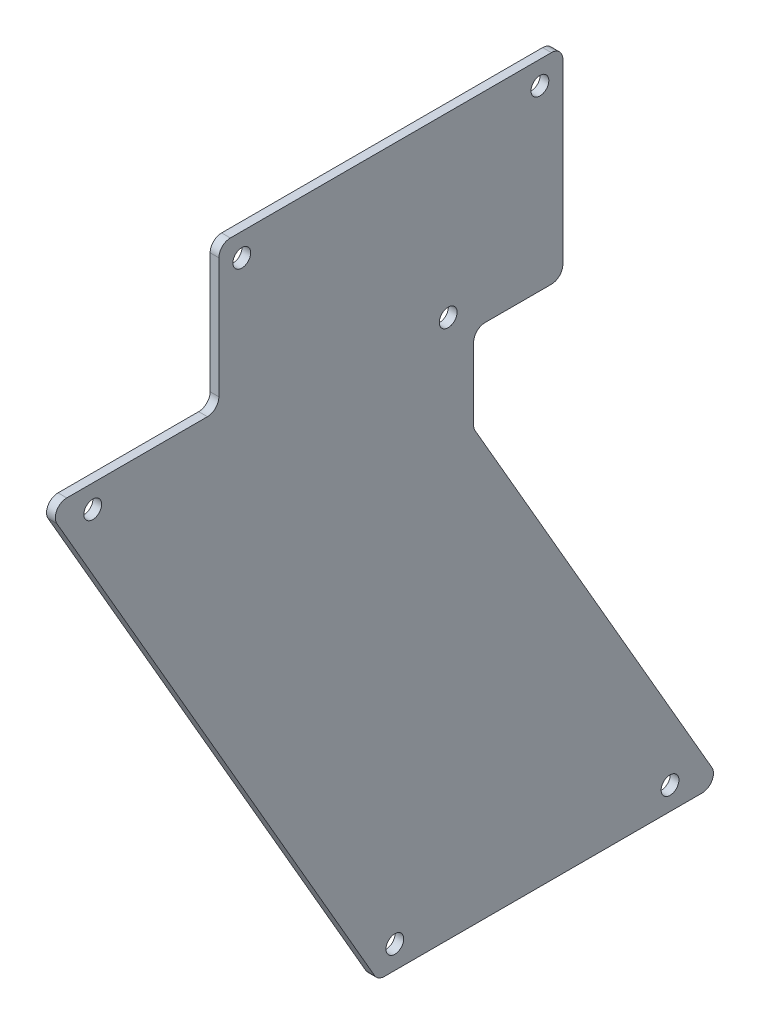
ISO-10303-21;
HEADER;
FILE_DESCRIPTION(('STEP AP214'),'2;1');
FILE_NAME('part.step','',(''),(''),'','','');
FILE_SCHEMA(('AUTOMOTIVE_DESIGN { 1 0 10303 214 1 1 1 1 }'));
ENDSEC;
DATA;
#1=APPLICATION_CONTEXT('core data for automotive mechanical design processes');
#2=APPLICATION_PROTOCOL_DEFINITION('international standard','automotive_design',2000,#1);
#3=PRODUCT_CONTEXT('',#1,'mechanical');
#4=PRODUCT('Part','Part','',(#3));
#5=PRODUCT_RELATED_PRODUCT_CATEGORY('part','',(#4));
#6=PRODUCT_DEFINITION_FORMATION('','',#4);
#7=PRODUCT_DEFINITION_CONTEXT('part definition',#1,'design');
#8=PRODUCT_DEFINITION('design','',#6,#7);
#9=PRODUCT_DEFINITION_SHAPE('','',#8);
#10=(LENGTH_UNIT() NAMED_UNIT(*) SI_UNIT(.MILLI.,.METRE.));
#11=(NAMED_UNIT(*) PLANE_ANGLE_UNIT() SI_UNIT($,.RADIAN.));
#12=(NAMED_UNIT(*) SI_UNIT($,.STERADIAN.) SOLID_ANGLE_UNIT());
#13=UNCERTAINTY_MEASURE_WITH_UNIT(LENGTH_MEASURE(1.E-05),#10,'distance_accuracy_value','');
#14=(GEOMETRIC_REPRESENTATION_CONTEXT(3) GLOBAL_UNCERTAINTY_ASSIGNED_CONTEXT((#13)) GLOBAL_UNIT_ASSIGNED_CONTEXT((#10,
#11,#12)) REPRESENTATION_CONTEXT('',''));
#15=CARTESIAN_POINT('',(0.,0.,0.));
#16=DIRECTION('',(0.,0.,1.));
#17=DIRECTION('',(1.,0.,0.));
#18=AXIS2_PLACEMENT_3D('',#15,#16,#17);
#19=CARTESIAN_POINT('',(1.524,0.,0.));
#20=DIRECTION('',(0.,1.,0.));
#21=DIRECTION('',(0.,0.,1.));
#22=AXIS2_PLACEMENT_3D('',#19,#20,#21);
#23=PLANE('',#22);
#24=DIRECTION('',(0.,0.,-1.));
#25=VECTOR('',#24,1.);
#26=CARTESIAN_POINT('',(0.,0.,0.));
#27=LINE('',#26,#25);
#28=CARTESIAN_POINT('',(0.,0.,18.8452994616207));
#29=VERTEX_POINT('',#28);
#30=CARTESIAN_POINT('',(0.,0.,-36.5358983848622));
#31=VERTEX_POINT('',#30);
#32=EDGE_CURVE('E186',#29,#31,#27,.T.);
#33=ORIENTED_EDGE('',*,*,#32,.T.);
#34=DIRECTION('',(-1.,0.,0.));
#35=VECTOR('',#34,1.);
#36=CARTESIAN_POINT('',(1.524,0.,-36.5358983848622));
#37=LINE('',#36,#35);
#38=CARTESIAN_POINT('',(1.524,0.,-36.5358983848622));
#39=VERTEX_POINT('',#38);
#40=EDGE_CURVE('E163',#31,#39,#37,.F.);
#41=ORIENTED_EDGE('',*,*,#40,.T.);
#42=DIRECTION('',(0.,0.,-1.));
#43=VECTOR('',#42,1.);
#44=CARTESIAN_POINT('',(1.524,0.,20.));
#45=LINE('',#44,#43);
#46=CARTESIAN_POINT('',(1.524,0.,18.8452994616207));
#47=VERTEX_POINT('',#46);
#48=EDGE_CURVE('E211',#47,#39,#45,.T.);
#49=ORIENTED_EDGE('',*,*,#48,.F.);
#50=DIRECTION('',(-1.,0.,0.));
#51=VECTOR('',#50,1.);
#52=CARTESIAN_POINT('',(1.524,0.,18.8452994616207));
#53=LINE('',#52,#51);
#54=EDGE_CURVE('E168',#47,#29,#53,.T.);
#55=ORIENTED_EDGE('',*,*,#54,.T.);
#56=EDGE_LOOP('',(#33,#41,#49,#55));
#57=FACE_BOUND('',#56,.T.);
#58=ADVANCED_FACE('F32',(#57),#23,.F.);
#59=CARTESIAN_POINT('',(1.524,0.,-40.));
#60=DIRECTION('',(0.,-0.500000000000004,0.866025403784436));
#61=DIRECTION('',(0.,-0.866025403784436,-0.500000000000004));
#62=AXIS2_PLACEMENT_3D('',#59,#60,#61);
#63=PLANE('',#62);
#64=DIRECTION('',(0.,0.866025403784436,0.500000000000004));
#65=VECTOR('',#64,1.);
#66=CARTESIAN_POINT('',(1.524,0.,-40.));
#67=LINE('',#66,#65);
#68=CARTESIAN_POINT('',(1.524,3.00000000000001,-38.2679491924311));
#69=VERTEX_POINT('',#68);
#70=CARTESIAN_POINT('',(1.524,74.5358983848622,3.03332099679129));
#71=VERTEX_POINT('',#70);
#72=EDGE_CURVE('E178',#69,#71,#67,.T.);
#73=ORIENTED_EDGE('',*,*,#72,.F.);
#74=DIRECTION('',(-1.,0.,0.));
#75=VECTOR('',#74,1.);
#76=CARTESIAN_POINT('',(1.524,3.00000000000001,-38.2679491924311));
#77=LINE('',#76,#75);
#78=CARTESIAN_POINT('',(0.,3.00000000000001,-38.2679491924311));
#79=VERTEX_POINT('',#78);
#80=EDGE_CURVE('E162',#69,#79,#77,.T.);
#81=ORIENTED_EDGE('',*,*,#80,.T.);
#82=DIRECTION('',(0.,0.866025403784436,0.500000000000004));
#83=VECTOR('',#82,1.);
#84=CARTESIAN_POINT('',(0.,0.,-40.));
#85=LINE('',#84,#83);
#86=CARTESIAN_POINT('',(0.,74.5358983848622,3.03332099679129));
#87=VERTEX_POINT('',#86);
#88=EDGE_CURVE('E175',#79,#87,#85,.T.);
#89=ORIENTED_EDGE('',*,*,#88,.T.);
#90=DIRECTION('',(-1.,0.,0.));
#91=VECTOR('',#90,1.);
#92=CARTESIAN_POINT('',(1.524,74.5358983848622,3.03332099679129));
#93=LINE('',#92,#91);
#94=EDGE_CURVE('E180',#87,#71,#93,.F.);
#95=ORIENTED_EDGE('',*,*,#94,.T.);
#96=EDGE_LOOP('',(#73,#81,#89,#95));
#97=FACE_BOUND('',#96,.T.);
#98=ADVANCED_FACE('F174',(#97),#63,.F.);
#99=CARTESIAN_POINT('',(1.524,75.,3.30127018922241));
#100=DIRECTION('',(0.,0.,1.));
#101=DIRECTION('',(0.,-1.,0.));
#102=AXIS2_PLACEMENT_3D('',#99,#100,#101);
#103=PLANE('',#102);
#104=DIRECTION('',(0.,1.,0.));
#105=VECTOR('',#104,1.);
#106=CARTESIAN_POINT('',(1.524,75.,3.30127018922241));
#107=LINE('',#106,#105);
#108=CARTESIAN_POINT('',(1.524,75.5358983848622,3.30127018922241));
#109=VERTEX_POINT('',#108);
#110=CARTESIAN_POINT('',(1.524,88.,3.30127018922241));
#111=VERTEX_POINT('',#110);
#112=EDGE_CURVE('E308',#109,#111,#107,.T.);
#113=ORIENTED_EDGE('',*,*,#112,.F.);
#114=DIRECTION('',(-1.,0.,0.));
#115=VECTOR('',#114,1.);
#116=CARTESIAN_POINT('',(0.,75.5358983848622,3.30127018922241));
#117=LINE('',#116,#115);
#118=CARTESIAN_POINT('',(0.,75.5358983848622,3.30127018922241));
#119=VERTEX_POINT('',#118);
#120=EDGE_CURVE('E242',#109,#119,#117,.T.);
#121=ORIENTED_EDGE('',*,*,#120,.T.);
#122=DIRECTION('',(0.,1.,0.));
#123=VECTOR('',#122,1.);
#124=CARTESIAN_POINT('',(0.,75.,3.30127018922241));
#125=LINE('',#124,#123);
#126=CARTESIAN_POINT('',(0.,88.,3.30127018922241));
#127=VERTEX_POINT('',#126);
#128=EDGE_CURVE('E185',#119,#127,#125,.T.);
#129=ORIENTED_EDGE('',*,*,#128,.T.);
#130=DIRECTION('',(-1.,0.,0.));
#131=VECTOR('',#130,1.);
#132=CARTESIAN_POINT('',(1.524,88.,3.30127018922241));
#133=LINE('',#132,#131);
#134=EDGE_CURVE('E240',#127,#111,#133,.F.);
#135=ORIENTED_EDGE('',*,*,#134,.T.);
#136=EDGE_LOOP('',(#113,#121,#129,#135));
#137=FACE_BOUND('',#136,.T.);
#138=ADVANCED_FACE('F386',(#137),#103,.F.);
#139=CARTESIAN_POINT('',(1.524,90.,3.30127018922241));
#140=DIRECTION('',(0.,1.,0.));
#141=DIRECTION('',(0.,0.,1.));
#142=AXIS2_PLACEMENT_3D('',#139,#140,#141);
#143=PLANE('',#142);
#144=DIRECTION('',(0.,0.,-1.));
#145=VECTOR('',#144,1.);
#146=CARTESIAN_POINT('',(1.524,90.,3.30127018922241));
#147=LINE('',#146,#145);
#148=CARTESIAN_POINT('',(1.524,90.,1.30127018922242));
#149=VERTEX_POINT('',#148);
#150=CARTESIAN_POINT('',(1.524,90.,-10.2649730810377));
#151=VERTEX_POINT('',#150);
#152=EDGE_CURVE('E305',#149,#151,#147,.T.);
#153=ORIENTED_EDGE('',*,*,#152,.F.);
#154=DIRECTION('',(-1.,0.,0.));
#155=VECTOR('',#154,1.);
#156=CARTESIAN_POINT('',(0.,90.,1.30127018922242));
#157=LINE('',#156,#155);
#158=CARTESIAN_POINT('',(0.,90.,1.30127018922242));
#159=VERTEX_POINT('',#158);
#160=EDGE_CURVE('E247',#149,#159,#157,.T.);
#161=ORIENTED_EDGE('',*,*,#160,.T.);
#162=DIRECTION('',(0.,0.,-1.));
#163=VECTOR('',#162,1.);
#164=CARTESIAN_POINT('',(0.,90.,3.30127018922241));
#165=LINE('',#164,#163);
#166=CARTESIAN_POINT('',(0.,90.,-10.2649730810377));
#167=VERTEX_POINT('',#166);
#168=EDGE_CURVE('E189',#159,#167,#165,.T.);
#169=ORIENTED_EDGE('',*,*,#168,.T.);
#170=DIRECTION('',(-1.,0.,0.));
#171=VECTOR('',#170,1.);
#172=CARTESIAN_POINT('',(1.524,90.,-10.2649730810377));
#173=LINE('',#172,#171);
#174=EDGE_CURVE('E245',#167,#151,#173,.F.);
#175=ORIENTED_EDGE('',*,*,#174,.T.);
#176=EDGE_LOOP('',(#153,#161,#169,#175));
#177=FACE_BOUND('',#176,.T.);
#178=ADVANCED_FACE('F437',(#177),#143,.F.);
#179=CARTESIAN_POINT('',(1.524,90.,-12.2649730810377));
#180=DIRECTION('',(0.,0.,1.));
#181=DIRECTION('',(1.,0.,0.));
#182=AXIS2_PLACEMENT_3D('',#179,#180,#181);
#183=PLANE('',#182);
#184=DIRECTION('',(0.,1.,0.));
#185=VECTOR('',#184,1.);
#186=CARTESIAN_POINT('',(1.524,90.,-12.2649730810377));
#187=LINE('',#186,#185);
#188=CARTESIAN_POINT('',(1.524,92.,-12.2649730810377));
#189=VERTEX_POINT('',#188);
#190=CARTESIAN_POINT('',(1.524,123.,-12.2649730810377));
#191=VERTEX_POINT('',#190);
#192=EDGE_CURVE('E302',#189,#191,#187,.T.);
#193=ORIENTED_EDGE('',*,*,#192,.F.);
#194=DIRECTION('',(-1.,0.,0.));
#195=VECTOR('',#194,1.);
#196=CARTESIAN_POINT('',(1.524,92.,-12.2649730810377));
#197=LINE('',#196,#195);
#198=CARTESIAN_POINT('',(0.,92.,-12.2649730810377));
#199=VERTEX_POINT('',#198);
#200=EDGE_CURVE('E252',#189,#199,#197,.T.);
#201=ORIENTED_EDGE('',*,*,#200,.T.);
#202=DIRECTION('',(0.,1.,0.));
#203=VECTOR('',#202,1.);
#204=CARTESIAN_POINT('',(0.,90.,-12.2649730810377));
#205=LINE('',#204,#203);
#206=CARTESIAN_POINT('',(0.,123.,-12.2649730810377));
#207=VERTEX_POINT('',#206);
#208=EDGE_CURVE('E197',#199,#207,#205,.T.);
#209=ORIENTED_EDGE('',*,*,#208,.T.);
#210=DIRECTION('',(-1.,0.,0.));
#211=VECTOR('',#210,1.);
#212=CARTESIAN_POINT('',(1.524,123.,-12.2649730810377));
#213=LINE('',#212,#211);
#214=EDGE_CURVE('E250',#207,#191,#213,.F.);
#215=ORIENTED_EDGE('',*,*,#214,.T.);
#216=EDGE_LOOP('',(#193,#201,#209,#215));
#217=FACE_BOUND('',#216,.T.);
#218=ADVANCED_FACE('F444',(#217),#183,.F.);
#219=CARTESIAN_POINT('',(1.524,125.,-12.2649730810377));
#220=DIRECTION('',(0.,-1.,0.));
#221=DIRECTION('',(0.,0.,-1.));
#222=AXIS2_PLACEMENT_3D('',#219,#220,#221);
#223=PLANE('',#222);
#224=DIRECTION('',(0.,0.,1.));
#225=VECTOR('',#224,1.);
#226=CARTESIAN_POINT('',(1.524,125.,-12.2649730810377));
#227=LINE('',#226,#225);
#228=CARTESIAN_POINT('',(1.524,125.,-10.2649730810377));
#229=VERTEX_POINT('',#228);
#230=CARTESIAN_POINT('',(1.524,125.,45.7350269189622));
#231=VERTEX_POINT('',#230);
#232=EDGE_CURVE('E297',#229,#231,#227,.T.);
#233=ORIENTED_EDGE('',*,*,#232,.F.);
#234=DIRECTION('',(-1.,0.,0.));
#235=VECTOR('',#234,1.);
#236=CARTESIAN_POINT('',(1.524,125.,-10.2649730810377));
#237=LINE('',#236,#235);
#238=CARTESIAN_POINT('',(0.,125.,-10.2649730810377));
#239=VERTEX_POINT('',#238);
#240=EDGE_CURVE('E257',#229,#239,#237,.T.);
#241=ORIENTED_EDGE('',*,*,#240,.T.);
#242=DIRECTION('',(0.,0.,1.));
#243=VECTOR('',#242,1.);
#244=CARTESIAN_POINT('',(0.,125.,-12.2649730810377));
#245=LINE('',#244,#243);
#246=CARTESIAN_POINT('',(0.,125.,45.7350269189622));
#247=VERTEX_POINT('',#246);
#248=EDGE_CURVE('E200',#239,#247,#245,.T.);
#249=ORIENTED_EDGE('',*,*,#248,.T.);
#250=DIRECTION('',(-1.,0.,0.));
#251=VECTOR('',#250,1.);
#252=CARTESIAN_POINT('',(1.524,125.,45.7350269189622));
#253=LINE('',#252,#251);
#254=EDGE_CURVE('E255',#247,#231,#253,.F.);
#255=ORIENTED_EDGE('',*,*,#254,.T.);
#256=EDGE_LOOP('',(#233,#241,#249,#255));
#257=FACE_BOUND('',#256,.T.);
#258=ADVANCED_FACE('F451',(#257),#223,.F.);
#259=CARTESIAN_POINT('',(1.524,125.,47.7350269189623));
#260=DIRECTION('',(0.,0.,-1.));
#261=DIRECTION('',(-1.,0.,0.));
#262=AXIS2_PLACEMENT_3D('',#259,#260,#261);
#263=PLANE('',#262);
#264=DIRECTION('',(0.,-1.,0.));
#265=VECTOR('',#264,1.);
#266=CARTESIAN_POINT('',(1.524,125.,47.7350269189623));
#267=LINE('',#266,#265);
#268=CARTESIAN_POINT('',(1.524,123.,47.7350269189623));
#269=VERTEX_POINT('',#268);
#270=CARTESIAN_POINT('',(1.524,102.,47.7350269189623));
#271=VERTEX_POINT('',#270);
#272=EDGE_CURVE('E292',#269,#271,#267,.T.);
#273=ORIENTED_EDGE('',*,*,#272,.F.);
#274=DIRECTION('',(-1.,0.,0.));
#275=VECTOR('',#274,1.);
#276=CARTESIAN_POINT('',(1.524,123.,47.7350269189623));
#277=LINE('',#276,#275);
#278=CARTESIAN_POINT('',(0.,123.,47.7350269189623));
#279=VERTEX_POINT('',#278);
#280=EDGE_CURVE('E262',#269,#279,#277,.T.);
#281=ORIENTED_EDGE('',*,*,#280,.T.);
#282=DIRECTION('',(0.,-1.,0.));
#283=VECTOR('',#282,1.);
#284=CARTESIAN_POINT('',(0.,125.,47.7350269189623));
#285=LINE('',#284,#283);
#286=CARTESIAN_POINT('',(0.,102.,47.7350269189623));
#287=VERTEX_POINT('',#286);
#288=EDGE_CURVE('E203',#279,#287,#285,.T.);
#289=ORIENTED_EDGE('',*,*,#288,.T.);
#290=DIRECTION('',(-1.,0.,0.));
#291=VECTOR('',#290,1.);
#292=CARTESIAN_POINT('',(1.524,102.,47.7350269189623));
#293=LINE('',#292,#291);
#294=EDGE_CURVE('E260',#287,#271,#293,.F.);
#295=ORIENTED_EDGE('',*,*,#294,.T.);
#296=EDGE_LOOP('',(#273,#281,#289,#295));
#297=FACE_BOUND('',#296,.T.);
#298=ADVANCED_FACE('F283',(#297),#263,.F.);
#299=CARTESIAN_POINT('',(1.524,100.,47.7350269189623));
#300=DIRECTION('',(0.,-1.,0.));
#301=DIRECTION('',(0.,0.,-1.));
#302=AXIS2_PLACEMENT_3D('',#299,#300,#301);
#303=PLANE('',#302);
#304=DIRECTION('',(0.,0.,1.));
#305=VECTOR('',#304,1.);
#306=CARTESIAN_POINT('',(1.524,100.,47.7350269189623));
#307=LINE('',#306,#305);
#308=CARTESIAN_POINT('',(1.524,100.,49.7350269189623));
#309=VERTEX_POINT('',#308);
#310=CARTESIAN_POINT('',(1.524,100.,74.2709253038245));
#311=VERTEX_POINT('',#310);
#312=EDGE_CURVE('E291',#309,#311,#307,.T.);
#313=ORIENTED_EDGE('',*,*,#312,.F.);
#314=DIRECTION('',(-1.,0.,0.));
#315=VECTOR('',#314,1.);
#316=CARTESIAN_POINT('',(0.,100.,49.7350269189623));
#317=LINE('',#316,#315);
#318=CARTESIAN_POINT('',(0.,100.,49.7350269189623));
#319=VERTEX_POINT('',#318);
#320=EDGE_CURVE('E267',#309,#319,#317,.T.);
#321=ORIENTED_EDGE('',*,*,#320,.T.);
#322=DIRECTION('',(0.,0.,1.));
#323=VECTOR('',#322,1.);
#324=CARTESIAN_POINT('',(0.,100.,47.7350269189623));
#325=LINE('',#324,#323);
#326=CARTESIAN_POINT('',(0.,100.,74.2709253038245));
#327=VERTEX_POINT('',#326);
#328=EDGE_CURVE('E206',#319,#327,#325,.T.);
#329=ORIENTED_EDGE('',*,*,#328,.T.);
#330=DIRECTION('',(-1.,0.,0.));
#331=VECTOR('',#330,1.);
#332=CARTESIAN_POINT('',(1.524,100.,74.2709253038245));
#333=LINE('',#332,#331);
#334=EDGE_CURVE('E265',#327,#311,#333,.F.);
#335=ORIENTED_EDGE('',*,*,#334,.T.);
#336=EDGE_LOOP('',(#313,#321,#329,#335));
#337=FACE_BOUND('',#336,.T.);
#338=ADVANCED_FACE('F294',(#337),#303,.F.);
#339=CARTESIAN_POINT('',(1.524,100.,77.7350269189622));
#340=DIRECTION('',(0.,0.499999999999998,-0.86602540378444));
#341=DIRECTION('',(0.,0.86602540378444,0.499999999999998));
#342=AXIS2_PLACEMENT_3D('',#339,#340,#341);
#343=PLANE('',#342);
#344=DIRECTION('',(0.,-0.86602540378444,-0.499999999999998));
#345=VECTOR('',#344,1.);
#346=CARTESIAN_POINT('',(0.,100.,77.7350269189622));
#347=LINE('',#346,#345);
#348=CARTESIAN_POINT('',(0.,97.,76.0029761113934));
#349=VERTEX_POINT('',#348);
#350=CARTESIAN_POINT('',(0.,1.,20.5773502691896));
#351=VERTEX_POINT('',#350);
#352=EDGE_CURVE('E209',#349,#351,#347,.T.);
#353=ORIENTED_EDGE('',*,*,#352,.T.);
#354=DIRECTION('',(-1.,0.,0.));
#355=VECTOR('',#354,1.);
#356=CARTESIAN_POINT('',(1.524,1.,20.5773502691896));
#357=LINE('',#356,#355);
#358=CARTESIAN_POINT('',(1.524,1.,20.5773502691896));
#359=VERTEX_POINT('',#358);
#360=EDGE_CURVE('E47',#351,#359,#357,.F.);
#361=ORIENTED_EDGE('',*,*,#360,.T.);
#362=DIRECTION('',(0.,-0.86602540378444,-0.499999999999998));
#363=VECTOR('',#362,1.);
#364=CARTESIAN_POINT('',(1.524,100.,77.7350269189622));
#365=LINE('',#364,#363);
#366=CARTESIAN_POINT('',(1.524,97.,76.0029761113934));
#367=VERTEX_POINT('',#366);
#368=EDGE_CURVE('E212',#367,#359,#365,.T.);
#369=ORIENTED_EDGE('',*,*,#368,.F.);
#370=DIRECTION('',(-1.,0.,0.));
#371=VECTOR('',#370,1.);
#372=CARTESIAN_POINT('',(1.524,97.,76.0029761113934));
#373=LINE('',#372,#371);
#374=EDGE_CURVE('E236',#367,#349,#373,.T.);
#375=ORIENTED_EDGE('',*,*,#374,.T.);
#376=EDGE_LOOP('',(#353,#361,#369,#375));
#377=FACE_BOUND('',#376,.T.);
#378=ADVANCED_FACE('F353',(#377),#343,.F.);
#379=CARTESIAN_POINT('',(1.524,0.,0.));
#380=DIRECTION('',(1.,0.,0.));
#381=DIRECTION('',(0.,0.,-1.));
#382=AXIS2_PLACEMENT_3D('',#379,#380,#381);
#383=PLANE('',#382);
#384=CARTESIAN_POINT('',(1.524,121.,43.7350269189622));
#385=DIRECTION('',(1.,0.,0.));
#386=DIRECTION('',(0.,0.,-1.));
#387=AXIS2_PLACEMENT_3D('',#384,#385,#386);
#388=CIRCLE('',#387,1.54999999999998);
#389=CARTESIAN_POINT('',(1.524,121.,42.1850269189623));
#390=VERTEX_POINT('',#389);
#391=EDGE_CURVE('E345',#390,#390,#388,.T.);
#392=ORIENTED_EDGE('',*,*,#391,.F.);
#393=EDGE_LOOP('',(#392));
#394=FACE_BOUND('',#393,.T.);
#395=CARTESIAN_POINT('',(1.524,121.,-8.26497308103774));
#396=DIRECTION('',(1.,0.,0.));
#397=DIRECTION('',(0.,0.,-1.));
#398=AXIS2_PLACEMENT_3D('',#395,#396,#397);
#399=CIRCLE('',#398,1.54999999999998);
#400=CARTESIAN_POINT('',(1.524,121.,-9.81497308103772));
#401=VERTEX_POINT('',#400);
#402=EDGE_CURVE('E339',#401,#401,#399,.T.);
#403=ORIENTED_EDGE('',*,*,#402,.F.);
#404=EDGE_LOOP('',(#403));
#405=FACE_BOUND('',#404,.T.);
#406=CARTESIAN_POINT('',(1.524,96.,69.7350269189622));
#407=DIRECTION('',(1.,0.,0.));
#408=DIRECTION('',(0.,0.,-1.));
#409=AXIS2_PLACEMENT_3D('',#406,#407,#408);
#410=CIRCLE('',#409,1.54999999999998);
#411=CARTESIAN_POINT('',(1.524,96.,68.1850269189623));
#412=VERTEX_POINT('',#411);
#413=EDGE_CURVE('E333',#412,#412,#410,.T.);
#414=ORIENTED_EDGE('',*,*,#413,.F.);
#415=EDGE_LOOP('',(#414));
#416=FACE_BOUND('',#415,.T.);
#417=CARTESIAN_POINT('',(1.524,4.,17.04));
#418=DIRECTION('',(1.,0.,0.));
#419=DIRECTION('',(0.,0.,-1.));
#420=AXIS2_PLACEMENT_3D('',#417,#418,#419);
#421=CIRCLE('',#420,1.54999999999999);
#422=CARTESIAN_POINT('',(1.524,4.,15.49));
#423=VERTEX_POINT('',#422);
#424=EDGE_CURVE('E327',#423,#423,#421,.T.);
#425=ORIENTED_EDGE('',*,*,#424,.F.);
#426=EDGE_LOOP('',(#425));
#427=FACE_BOUND('',#426,.T.);
#428=CARTESIAN_POINT('',(1.524,4.,-30.96));
#429=DIRECTION('',(1.,0.,0.));
#430=DIRECTION('',(0.,0.,-1.));
#431=AXIS2_PLACEMENT_3D('',#428,#429,#430);
#432=CIRCLE('',#431,1.54999999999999);
#433=CARTESIAN_POINT('',(1.524,4.,-32.51));
#434=VERTEX_POINT('',#433);
#435=EDGE_CURVE('E321',#434,#434,#432,.T.);
#436=ORIENTED_EDGE('',*,*,#435,.F.);
#437=EDGE_LOOP('',(#436));
#438=FACE_BOUND('',#437,.T.);
#439=CARTESIAN_POINT('',(1.524,94.,7.73502691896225));
#440=DIRECTION('',(1.,0.,0.));
#441=DIRECTION('',(0.,0.,-1.));
#442=AXIS2_PLACEMENT_3D('',#439,#440,#441);
#443=CIRCLE('',#442,1.54999999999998);
#444=CARTESIAN_POINT('',(1.524,94.,6.18502691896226));
#445=VERTEX_POINT('',#444);
#446=EDGE_CURVE('E315',#445,#445,#443,.T.);
#447=ORIENTED_EDGE('',*,*,#446,.F.);
#448=EDGE_LOOP('',(#447));
#449=FACE_BOUND('',#448,.T.);
#450=ORIENTED_EDGE('',*,*,#48,.T.);
#451=CARTESIAN_POINT('',(1.524,2.,-36.5358983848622));
#452=DIRECTION('',(1.,0.,0.));
#453=DIRECTION('',(0.,0.,-1.));
#454=AXIS2_PLACEMENT_3D('',#451,#452,#453);
#455=CIRCLE('',#454,2.);
#456=EDGE_CURVE('E234',#39,#69,#455,.T.);
#457=ORIENTED_EDGE('',*,*,#456,.T.);
#458=ORIENTED_EDGE('',*,*,#72,.T.);
#459=CARTESIAN_POINT('',(1.524,75.5358983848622,1.30127018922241));
#460=DIRECTION('',(1.,0.,0.));
#461=DIRECTION('',(0.,0.,-1.));
#462=AXIS2_PLACEMENT_3D('',#459,#460,#461);
#463=CIRCLE('',#462,2.);
#464=EDGE_CURVE('E271',#71,#109,#463,.F.);
#465=ORIENTED_EDGE('',*,*,#464,.T.);
#466=ORIENTED_EDGE('',*,*,#112,.T.);
#467=CARTESIAN_POINT('',(1.524,88.,1.30127018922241));
#468=DIRECTION('',(1.,0.,0.));
#469=DIRECTION('',(0.,0.,-1.));
#470=AXIS2_PLACEMENT_3D('',#467,#468,#469);
#471=CIRCLE('',#470,2.);
#472=EDGE_CURVE('E275',#111,#149,#471,.F.);
#473=ORIENTED_EDGE('',*,*,#472,.T.);
#474=ORIENTED_EDGE('',*,*,#152,.T.);
#475=CARTESIAN_POINT('',(1.524,92.,-10.2649730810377));
#476=DIRECTION('',(1.,0.,0.));
#477=DIRECTION('',(0.,0.,-1.));
#478=AXIS2_PLACEMENT_3D('',#475,#476,#477);
#479=CIRCLE('',#478,2.);
#480=EDGE_CURVE('E230',#151,#189,#479,.T.);
#481=ORIENTED_EDGE('',*,*,#480,.T.);
#482=ORIENTED_EDGE('',*,*,#192,.T.);
#483=CARTESIAN_POINT('',(1.524,123.,-10.2649730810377));
#484=DIRECTION('',(1.,0.,0.));
#485=DIRECTION('',(0.,0.,-1.));
#486=AXIS2_PLACEMENT_3D('',#483,#484,#485);
#487=CIRCLE('',#486,2.);
#488=EDGE_CURVE('E228',#191,#229,#487,.T.);
#489=ORIENTED_EDGE('',*,*,#488,.T.);
#490=ORIENTED_EDGE('',*,*,#232,.T.);
#491=CARTESIAN_POINT('',(1.524,123.,45.7350269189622));
#492=DIRECTION('',(1.,0.,0.));
#493=DIRECTION('',(0.,0.,-1.));
#494=AXIS2_PLACEMENT_3D('',#491,#492,#493);
#495=CIRCLE('',#494,2.);
#496=EDGE_CURVE('E226',#231,#269,#495,.T.);
#497=ORIENTED_EDGE('',*,*,#496,.T.);
#498=ORIENTED_EDGE('',*,*,#272,.T.);
#499=CARTESIAN_POINT('',(1.524,102.,49.7350269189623));
#500=DIRECTION('',(1.,0.,0.));
#501=DIRECTION('',(0.,0.,-1.));
#502=AXIS2_PLACEMENT_3D('',#499,#500,#501);
#503=CIRCLE('',#502,2.);
#504=EDGE_CURVE('E11',#271,#309,#503,.F.);
#505=ORIENTED_EDGE('',*,*,#504,.T.);
#506=ORIENTED_EDGE('',*,*,#312,.T.);
#507=CARTESIAN_POINT('',(1.524,98.,74.2709253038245));
#508=DIRECTION('',(1.,0.,0.));
#509=DIRECTION('',(0.,0.,-1.));
#510=AXIS2_PLACEMENT_3D('',#507,#508,#509);
#511=CIRCLE('',#510,2.);
#512=EDGE_CURVE('E54',#311,#367,#511,.T.);
#513=ORIENTED_EDGE('',*,*,#512,.T.);
#514=ORIENTED_EDGE('',*,*,#368,.T.);
#515=CARTESIAN_POINT('',(1.524,2.,18.8452994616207));
#516=DIRECTION('',(1.,0.,0.));
#517=DIRECTION('',(0.,0.,-1.));
#518=AXIS2_PLACEMENT_3D('',#515,#516,#517);
#519=CIRCLE('',#518,2.);
#520=EDGE_CURVE('E232',#359,#47,#519,.T.);
#521=ORIENTED_EDGE('',*,*,#520,.T.);
#522=EDGE_LOOP('',(#450,#457,#458,#465,#466,#473,#474,#481,#482,#489,#490,#497,#498,#505,#506,
#513,#514,#521));
#523=FACE_BOUND('',#522,.T.);
#524=ADVANCED_FACE('F290',(#394,#405,#416,#427,#438,#449,#523),#383,.T.);
#525=CARTESIAN_POINT('',(0.,0.,0.));
#526=DIRECTION('',(1.,0.,0.));
#527=DIRECTION('',(0.,0.,-1.));
#528=AXIS2_PLACEMENT_3D('',#525,#526,#527);
#529=PLANE('',#528);
#530=CARTESIAN_POINT('',(0.,121.,43.7350269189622));
#531=DIRECTION('',(1.,0.,0.));
#532=DIRECTION('',(0.,0.,-1.));
#533=AXIS2_PLACEMENT_3D('',#530,#531,#532);
#534=CIRCLE('',#533,1.55);
#535=CARTESIAN_POINT('',(0.,121.,42.1850269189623));
#536=VERTEX_POINT('',#535);
#537=EDGE_CURVE('E342',#536,#536,#534,.T.);
#538=ORIENTED_EDGE('',*,*,#537,.T.);
#539=EDGE_LOOP('',(#538));
#540=FACE_BOUND('',#539,.T.);
#541=CARTESIAN_POINT('',(0.,121.,-8.26497308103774));
#542=DIRECTION('',(1.,0.,0.));
#543=DIRECTION('',(0.,0.,-1.));
#544=AXIS2_PLACEMENT_3D('',#541,#542,#543);
#545=CIRCLE('',#544,1.55);
#546=CARTESIAN_POINT('',(0.,121.,-9.81497308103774));
#547=VERTEX_POINT('',#546);
#548=EDGE_CURVE('E336',#547,#547,#545,.T.);
#549=ORIENTED_EDGE('',*,*,#548,.T.);
#550=EDGE_LOOP('',(#549));
#551=FACE_BOUND('',#550,.T.);
#552=CARTESIAN_POINT('',(0.,96.,69.7350269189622));
#553=DIRECTION('',(1.,0.,0.));
#554=DIRECTION('',(0.,0.,-1.));
#555=AXIS2_PLACEMENT_3D('',#552,#553,#554);
#556=CIRCLE('',#555,1.55);
#557=CARTESIAN_POINT('',(0.,96.,68.1850269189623));
#558=VERTEX_POINT('',#557);
#559=EDGE_CURVE('E330',#558,#558,#556,.T.);
#560=ORIENTED_EDGE('',*,*,#559,.T.);
#561=EDGE_LOOP('',(#560));
#562=FACE_BOUND('',#561,.T.);
#563=CARTESIAN_POINT('',(0.,4.,17.04));
#564=DIRECTION('',(1.,0.,0.));
#565=DIRECTION('',(0.,0.,-1.));
#566=AXIS2_PLACEMENT_3D('',#563,#564,#565);
#567=CIRCLE('',#566,1.55);
#568=CARTESIAN_POINT('',(0.,4.,15.49));
#569=VERTEX_POINT('',#568);
#570=EDGE_CURVE('E324',#569,#569,#567,.T.);
#571=ORIENTED_EDGE('',*,*,#570,.T.);
#572=EDGE_LOOP('',(#571));
#573=FACE_BOUND('',#572,.T.);
#574=CARTESIAN_POINT('',(0.,4.,-30.96));
#575=DIRECTION('',(1.,0.,0.));
#576=DIRECTION('',(0.,0.,-1.));
#577=AXIS2_PLACEMENT_3D('',#574,#575,#576);
#578=CIRCLE('',#577,1.55);
#579=CARTESIAN_POINT('',(0.,4.,-32.51));
#580=VERTEX_POINT('',#579);
#581=EDGE_CURVE('E318',#580,#580,#578,.T.);
#582=ORIENTED_EDGE('',*,*,#581,.T.);
#583=EDGE_LOOP('',(#582));
#584=FACE_BOUND('',#583,.T.);
#585=CARTESIAN_POINT('',(0.,94.,7.73502691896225));
#586=DIRECTION('',(1.,0.,0.));
#587=DIRECTION('',(0.,0.,-1.));
#588=AXIS2_PLACEMENT_3D('',#585,#586,#587);
#589=CIRCLE('',#588,1.55);
#590=CARTESIAN_POINT('',(0.,94.,6.18502691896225));
#591=VERTEX_POINT('',#590);
#592=EDGE_CURVE('E191',#591,#591,#589,.T.);
#593=ORIENTED_EDGE('',*,*,#592,.T.);
#594=EDGE_LOOP('',(#593));
#595=FACE_BOUND('',#594,.T.);
#596=ORIENTED_EDGE('',*,*,#88,.F.);
#597=CARTESIAN_POINT('',(0.,2.,-36.5358983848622));
#598=DIRECTION('',(1.,0.,0.));
#599=DIRECTION('',(0.,0.,-1.));
#600=AXIS2_PLACEMENT_3D('',#597,#598,#599);
#601=CIRCLE('',#600,2.);
#602=EDGE_CURVE('E158',#79,#31,#601,.F.);
#603=ORIENTED_EDGE('',*,*,#602,.T.);
#604=ORIENTED_EDGE('',*,*,#32,.F.);
#605=CARTESIAN_POINT('',(0.,2.,18.8452994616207));
#606=DIRECTION('',(1.,0.,0.));
#607=DIRECTION('',(0.,0.,-1.));
#608=AXIS2_PLACEMENT_3D('',#605,#606,#607);
#609=CIRCLE('',#608,2.);
#610=EDGE_CURVE('E169',#29,#351,#609,.F.);
#611=ORIENTED_EDGE('',*,*,#610,.T.);
#612=ORIENTED_EDGE('',*,*,#352,.F.);
#613=CARTESIAN_POINT('',(0.,98.,74.2709253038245));
#614=DIRECTION('',(1.,0.,0.));
#615=DIRECTION('',(0.,0.,-1.));
#616=AXIS2_PLACEMENT_3D('',#613,#614,#615);
#617=CIRCLE('',#616,2.);
#618=EDGE_CURVE('E179',#349,#327,#617,.F.);
#619=ORIENTED_EDGE('',*,*,#618,.T.);
#620=ORIENTED_EDGE('',*,*,#328,.F.);
#621=CARTESIAN_POINT('',(0.,102.,49.7350269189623));
#622=DIRECTION('',(1.,0.,0.));
#623=DIRECTION('',(0.,0.,-1.));
#624=AXIS2_PLACEMENT_3D('',#621,#622,#623);
#625=CIRCLE('',#624,2.);
#626=EDGE_CURVE('E40',#319,#287,#625,.T.);
#627=ORIENTED_EDGE('',*,*,#626,.T.);
#628=ORIENTED_EDGE('',*,*,#288,.F.);
#629=CARTESIAN_POINT('',(0.,123.,45.7350269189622));
#630=DIRECTION('',(1.,0.,0.));
#631=DIRECTION('',(0.,0.,-1.));
#632=AXIS2_PLACEMENT_3D('',#629,#630,#631);
#633=CIRCLE('',#632,2.);
#634=EDGE_CURVE('E215',#279,#247,#633,.F.);
#635=ORIENTED_EDGE('',*,*,#634,.T.);
#636=ORIENTED_EDGE('',*,*,#248,.F.);
#637=CARTESIAN_POINT('',(0.,123.,-10.2649730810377));
#638=DIRECTION('',(1.,0.,0.));
#639=DIRECTION('',(0.,0.,-1.));
#640=AXIS2_PLACEMENT_3D('',#637,#638,#639);
#641=CIRCLE('',#640,2.);
#642=EDGE_CURVE('E217',#239,#207,#641,.F.);
#643=ORIENTED_EDGE('',*,*,#642,.T.);
#644=ORIENTED_EDGE('',*,*,#208,.F.);
#645=CARTESIAN_POINT('',(0.,92.,-10.2649730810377));
#646=DIRECTION('',(1.,0.,0.));
#647=DIRECTION('',(0.,0.,-1.));
#648=AXIS2_PLACEMENT_3D('',#645,#646,#647);
#649=CIRCLE('',#648,2.);
#650=EDGE_CURVE('E219',#199,#167,#649,.F.);
#651=ORIENTED_EDGE('',*,*,#650,.T.);
#652=ORIENTED_EDGE('',*,*,#168,.F.);
#653=CARTESIAN_POINT('',(0.,88.,1.30127018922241));
#654=DIRECTION('',(1.,0.,0.));
#655=DIRECTION('',(0.,0.,-1.));
#656=AXIS2_PLACEMENT_3D('',#653,#654,#655);
#657=CIRCLE('',#656,2.);
#658=EDGE_CURVE('E273',#159,#127,#657,.T.);
#659=ORIENTED_EDGE('',*,*,#658,.T.);
#660=ORIENTED_EDGE('',*,*,#128,.F.);
#661=CARTESIAN_POINT('',(0.,75.5358983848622,1.30127018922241));
#662=DIRECTION('',(1.,0.,0.));
#663=DIRECTION('',(0.,0.,-1.));
#664=AXIS2_PLACEMENT_3D('',#661,#662,#663);
#665=CIRCLE('',#664,2.);
#666=EDGE_CURVE('E184',#119,#87,#665,.T.);
#667=ORIENTED_EDGE('',*,*,#666,.T.);
#668=EDGE_LOOP('',(#596,#603,#604,#611,#612,#619,#620,#627,#628,#635,#636,#643,#644,#651,#652,
#659,#660,#667));
#669=FACE_BOUND('',#668,.T.);
#670=ADVANCED_FACE('F182',(#540,#551,#562,#573,#584,#595,#669),#529,.F.);
#671=CARTESIAN_POINT('',(1.524,94.,7.73502691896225));
#672=DIRECTION('',(1.,0.,0.));
#673=DIRECTION('',(0.,0.,-1.));
#674=AXIS2_PLACEMENT_3D('',#671,#672,#673);
#675=CYLINDRICAL_SURFACE('',#674,1.54999999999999);
#676=ORIENTED_EDGE('',*,*,#592,.F.);
#677=EDGE_LOOP('',(#676));
#678=FACE_BOUND('',#677,.T.);
#679=ORIENTED_EDGE('',*,*,#446,.T.);
#680=EDGE_LOOP('',(#679));
#681=FACE_BOUND('',#680,.T.);
#682=ADVANCED_FACE('F365',(#678,#681),#675,.F.);
#683=CARTESIAN_POINT('',(1.524,4.,-30.96));
#684=DIRECTION('',(1.,0.,0.));
#685=DIRECTION('',(0.,0.,-1.));
#686=AXIS2_PLACEMENT_3D('',#683,#684,#685);
#687=CYLINDRICAL_SURFACE('',#686,1.54999999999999);
#688=ORIENTED_EDGE('',*,*,#581,.F.);
#689=EDGE_LOOP('',(#688));
#690=FACE_BOUND('',#689,.T.);
#691=ORIENTED_EDGE('',*,*,#435,.T.);
#692=EDGE_LOOP('',(#691));
#693=FACE_BOUND('',#692,.T.);
#694=ADVANCED_FACE('F367',(#690,#693),#687,.F.);
#695=CARTESIAN_POINT('',(1.524,4.,17.04));
#696=DIRECTION('',(1.,0.,0.));
#697=DIRECTION('',(0.,0.,-1.));
#698=AXIS2_PLACEMENT_3D('',#695,#696,#697);
#699=CYLINDRICAL_SURFACE('',#698,1.54999999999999);
#700=ORIENTED_EDGE('',*,*,#570,.F.);
#701=EDGE_LOOP('',(#700));
#702=FACE_BOUND('',#701,.T.);
#703=ORIENTED_EDGE('',*,*,#424,.T.);
#704=EDGE_LOOP('',(#703));
#705=FACE_BOUND('',#704,.T.);
#706=ADVANCED_FACE('F374',(#702,#705),#699,.F.);
#707=CARTESIAN_POINT('',(1.524,96.,69.7350269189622));
#708=DIRECTION('',(1.,0.,0.));
#709=DIRECTION('',(0.,0.,-1.));
#710=AXIS2_PLACEMENT_3D('',#707,#708,#709);
#711=CYLINDRICAL_SURFACE('',#710,1.54999999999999);
#712=ORIENTED_EDGE('',*,*,#559,.F.);
#713=EDGE_LOOP('',(#712));
#714=FACE_BOUND('',#713,.T.);
#715=ORIENTED_EDGE('',*,*,#413,.T.);
#716=EDGE_LOOP('',(#715));
#717=FACE_BOUND('',#716,.T.);
#718=ADVANCED_FACE('F582',(#714,#717),#711,.F.);
#719=CARTESIAN_POINT('',(1.524,121.,-8.26497308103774));
#720=DIRECTION('',(1.,0.,0.));
#721=DIRECTION('',(0.,0.,-1.));
#722=AXIS2_PLACEMENT_3D('',#719,#720,#721);
#723=CYLINDRICAL_SURFACE('',#722,1.54999999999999);
#724=ORIENTED_EDGE('',*,*,#548,.F.);
#725=EDGE_LOOP('',(#724));
#726=FACE_BOUND('',#725,.T.);
#727=ORIENTED_EDGE('',*,*,#402,.T.);
#728=EDGE_LOOP('',(#727));
#729=FACE_BOUND('',#728,.T.);
#730=ADVANCED_FACE('F575',(#726,#729),#723,.F.);
#731=CARTESIAN_POINT('',(1.524,121.,43.7350269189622));
#732=DIRECTION('',(1.,0.,0.));
#733=DIRECTION('',(0.,0.,-1.));
#734=AXIS2_PLACEMENT_3D('',#731,#732,#733);
#735=CYLINDRICAL_SURFACE('',#734,1.54999999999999);
#736=ORIENTED_EDGE('',*,*,#537,.F.);
#737=EDGE_LOOP('',(#736));
#738=FACE_BOUND('',#737,.T.);
#739=ORIENTED_EDGE('',*,*,#391,.T.);
#740=EDGE_LOOP('',(#739));
#741=FACE_BOUND('',#740,.T.);
#742=ADVANCED_FACE('F349',(#738,#741),#735,.F.);
#743=CARTESIAN_POINT('',(1.524,2.,-36.5358983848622));
#744=DIRECTION('',(-1.,0.,0.));
#745=DIRECTION('',(0.,0.,1.));
#746=AXIS2_PLACEMENT_3D('',#743,#744,#745);
#747=CYLINDRICAL_SURFACE('',#746,2.);
#748=ORIENTED_EDGE('',*,*,#456,.F.);
#749=ORIENTED_EDGE('',*,*,#40,.F.);
#750=ORIENTED_EDGE('',*,*,#602,.F.);
#751=ORIENTED_EDGE('',*,*,#80,.F.);
#752=EDGE_LOOP('',(#748,#749,#750,#751));
#753=FACE_BOUND('',#752,.T.);
#754=ADVANCED_FACE('F161',(#753),#747,.T.);
#755=CARTESIAN_POINT('',(1.524,2.,18.8452994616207));
#756=DIRECTION('',(-1.,0.,0.));
#757=DIRECTION('',(0.,0.,1.));
#758=AXIS2_PLACEMENT_3D('',#755,#756,#757);
#759=CYLINDRICAL_SURFACE('',#758,2.);
#760=ORIENTED_EDGE('',*,*,#520,.F.);
#761=ORIENTED_EDGE('',*,*,#360,.F.);
#762=ORIENTED_EDGE('',*,*,#610,.F.);
#763=ORIENTED_EDGE('',*,*,#54,.F.);
#764=EDGE_LOOP('',(#760,#761,#762,#763));
#765=FACE_BOUND('',#764,.T.);
#766=ADVANCED_FACE('F392',(#765),#759,.T.);
#767=CARTESIAN_POINT('',(1.524,75.5358983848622,1.30127018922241));
#768=DIRECTION('',(1.,0.,0.));
#769=DIRECTION('',(0.,0.,-1.));
#770=AXIS2_PLACEMENT_3D('',#767,#768,#769);
#771=CYLINDRICAL_SURFACE('',#770,2.);
#772=ORIENTED_EDGE('',*,*,#464,.F.);
#773=ORIENTED_EDGE('',*,*,#94,.F.);
#774=ORIENTED_EDGE('',*,*,#666,.F.);
#775=ORIENTED_EDGE('',*,*,#120,.F.);
#776=EDGE_LOOP('',(#772,#773,#774,#775));
#777=FACE_BOUND('',#776,.T.);
#778=ADVANCED_FACE('F395',(#777),#771,.F.);
#779=CARTESIAN_POINT('',(1.524,88.,1.30127018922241));
#780=DIRECTION('',(1.,0.,0.));
#781=DIRECTION('',(0.,0.,-1.));
#782=AXIS2_PLACEMENT_3D('',#779,#780,#781);
#783=CYLINDRICAL_SURFACE('',#782,2.);
#784=ORIENTED_EDGE('',*,*,#472,.F.);
#785=ORIENTED_EDGE('',*,*,#134,.F.);
#786=ORIENTED_EDGE('',*,*,#658,.F.);
#787=ORIENTED_EDGE('',*,*,#160,.F.);
#788=EDGE_LOOP('',(#784,#785,#786,#787));
#789=FACE_BOUND('',#788,.T.);
#790=ADVANCED_FACE('F399',(#789),#783,.F.);
#791=CARTESIAN_POINT('',(1.524,92.,-10.2649730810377));
#792=DIRECTION('',(-1.,0.,0.));
#793=DIRECTION('',(0.,0.,1.));
#794=AXIS2_PLACEMENT_3D('',#791,#792,#793);
#795=CYLINDRICAL_SURFACE('',#794,2.);
#796=ORIENTED_EDGE('',*,*,#480,.F.);
#797=ORIENTED_EDGE('',*,*,#174,.F.);
#798=ORIENTED_EDGE('',*,*,#650,.F.);
#799=ORIENTED_EDGE('',*,*,#200,.F.);
#800=EDGE_LOOP('',(#796,#797,#798,#799));
#801=FACE_BOUND('',#800,.T.);
#802=ADVANCED_FACE('F403',(#801),#795,.T.);
#803=CARTESIAN_POINT('',(1.524,123.,-10.2649730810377));
#804=DIRECTION('',(-1.,0.,0.));
#805=DIRECTION('',(0.,0.,1.));
#806=AXIS2_PLACEMENT_3D('',#803,#804,#805);
#807=CYLINDRICAL_SURFACE('',#806,2.);
#808=ORIENTED_EDGE('',*,*,#488,.F.);
#809=ORIENTED_EDGE('',*,*,#214,.F.);
#810=ORIENTED_EDGE('',*,*,#642,.F.);
#811=ORIENTED_EDGE('',*,*,#240,.F.);
#812=EDGE_LOOP('',(#808,#809,#810,#811));
#813=FACE_BOUND('',#812,.T.);
#814=ADVANCED_FACE('F407',(#813),#807,.T.);
#815=CARTESIAN_POINT('',(1.524,123.,45.7350269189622));
#816=DIRECTION('',(-1.,0.,0.));
#817=DIRECTION('',(0.,0.,1.));
#818=AXIS2_PLACEMENT_3D('',#815,#816,#817);
#819=CYLINDRICAL_SURFACE('',#818,2.);
#820=ORIENTED_EDGE('',*,*,#496,.F.);
#821=ORIENTED_EDGE('',*,*,#254,.F.);
#822=ORIENTED_EDGE('',*,*,#634,.F.);
#823=ORIENTED_EDGE('',*,*,#280,.F.);
#824=EDGE_LOOP('',(#820,#821,#822,#823));
#825=FACE_BOUND('',#824,.T.);
#826=ADVANCED_FACE('F411',(#825),#819,.T.);
#827=CARTESIAN_POINT('',(1.524,102.,49.7350269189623));
#828=DIRECTION('',(1.,0.,0.));
#829=DIRECTION('',(0.,0.,-1.));
#830=AXIS2_PLACEMENT_3D('',#827,#828,#829);
#831=CYLINDRICAL_SURFACE('',#830,2.);
#832=ORIENTED_EDGE('',*,*,#504,.F.);
#833=ORIENTED_EDGE('',*,*,#294,.F.);
#834=ORIENTED_EDGE('',*,*,#626,.F.);
#835=ORIENTED_EDGE('',*,*,#320,.F.);
#836=EDGE_LOOP('',(#832,#833,#834,#835));
#837=FACE_BOUND('',#836,.T.);
#838=ADVANCED_FACE('F287',(#837),#831,.F.);
#839=CARTESIAN_POINT('',(1.524,98.,74.2709253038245));
#840=DIRECTION('',(-1.,0.,0.));
#841=DIRECTION('',(0.,0.,1.));
#842=AXIS2_PLACEMENT_3D('',#839,#840,#841);
#843=CYLINDRICAL_SURFACE('',#842,2.);
#844=ORIENTED_EDGE('',*,*,#512,.F.);
#845=ORIENTED_EDGE('',*,*,#334,.F.);
#846=ORIENTED_EDGE('',*,*,#618,.F.);
#847=ORIENTED_EDGE('',*,*,#374,.F.);
#848=EDGE_LOOP('',(#844,#845,#846,#847));
#849=FACE_BOUND('',#848,.T.);
#850=ADVANCED_FACE('F34',(#849),#843,.T.);
#851=CLOSED_SHELL('',(#58,#98,#138,#178,#218,#258,#298,#338,#378,#524,#670,#682,#694,#706,#718,
#730,#742,#754,#766,#778,#790,#802,#814,#826,#838,#850));
#852=MANIFOLD_SOLID_BREP('B2',#851);
#853=ADVANCED_BREP_SHAPE_REPRESENTATION('',(#18,#852),#14);
#854=SHAPE_DEFINITION_REPRESENTATION(#9,#853);
ENDSEC;
END-ISO-10303-21;
